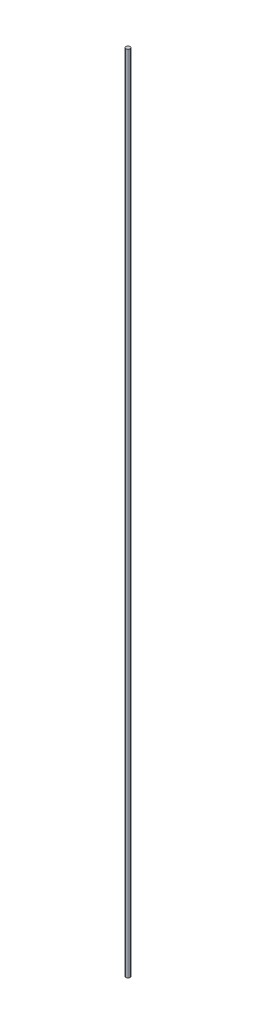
from build123d import *

# Parameters (mm, degrees)
SKETCH1_R           = 19.05
BOSS_EXTRUDE1_DEPTH = 7620


with BuildPart() as part:
    # Sketch1 → Boss-Extrude1 (new body)
    with BuildSketch(Plane(origin=(0, 0, 0), x_dir=(1, 0, 0), z_dir=(0, 1, 0))):
        with Locations(Location((0, 0, 0), (0, 0, 270))):
            Circle(SKETCH1_R)
    extrude(amount=BOSS_EXTRUDE1_DEPTH)


solid = part.part
